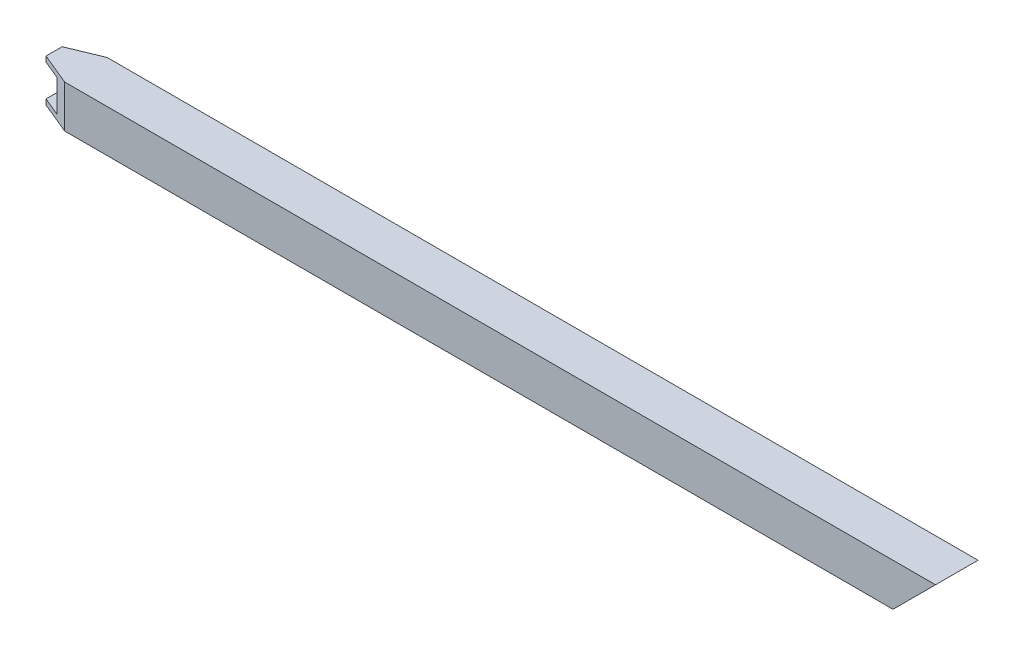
from build123d import *

# Parameters (mm, degrees)
SKETCH1_W           = 25.4
SKETCH1_H           = 25.4
SKETCH1_W_2         = 19.05
SKETCH1_H_2         = 19.05
BOSS_EXTRUDE1_DEPTH = 539.75
SKETCH2_OUTSIDE_W   = 649.938
SKETCH2_OUTSIDE_H   = 135.588
CUT_EXTRUDE1_DEPTH  = 541.496542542
SKETCH3_OUTSIDE_W   = 649.938
SKETCH3_OUTSIDE_H   = 135.588
CUT_EXTRUDE2_DEPTH  = 541.496542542


with BuildPart() as part:
    # Sketch1 → Boss-Extrude1 (new body)
    with BuildSketch(Plane(origin=(0, 0, 0), x_dir=(0, 0, -1), z_dir=(1, 0, 0))):
        Rectangle(SKETCH1_W, SKETCH1_H)
        Rectangle(SKETCH1_W_2, SKETCH1_H_2, mode=Mode.SUBTRACT)
    extrude(amount=BOSS_EXTRUDE1_DEPTH)

    # Sketch2 outside → Cut-Extrude1 (cut, through all)
    with BuildSketch(Plane(origin=(0, 0, -12.7), x_dir=(-1, 0, 0), z_dir=(0, 0, -1))):
        with Locations((-269.875, 0)):
            Rectangle(SKETCH2_OUTSIDE_W, SKETCH2_OUTSIDE_H)
        Polygon((-539.75, 12.7), (-514.35, -12.7), (0, -12.7), (0, 12.7), align=None, mode=Mode.SUBTRACT)
    extrude(amount=-CUT_EXTRUDE1_DEPTH, mode=Mode.SUBTRACT)

    # Sketch3 outside → Cut-Extrude2 (cut, through all)
    with BuildSketch(Plane(origin=(0, 12.7, 0), x_dir=(1, 0, 0), z_dir=(0, 1, 0))):
        with Locations((269.875, 0)):
            Rectangle(SKETCH3_OUTSIDE_W, SKETCH3_OUTSIDE_H)
        Polygon((539.75, -12.7), (539.75, 12.7), (19.05, 12.7), (0, 4.809231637), (0, -4.809231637), (19.05, -12.7), align=None, mode=Mode.SUBTRACT)
    extrude(amount=-CUT_EXTRUDE2_DEPTH, mode=Mode.SUBTRACT)


solid = part.part
